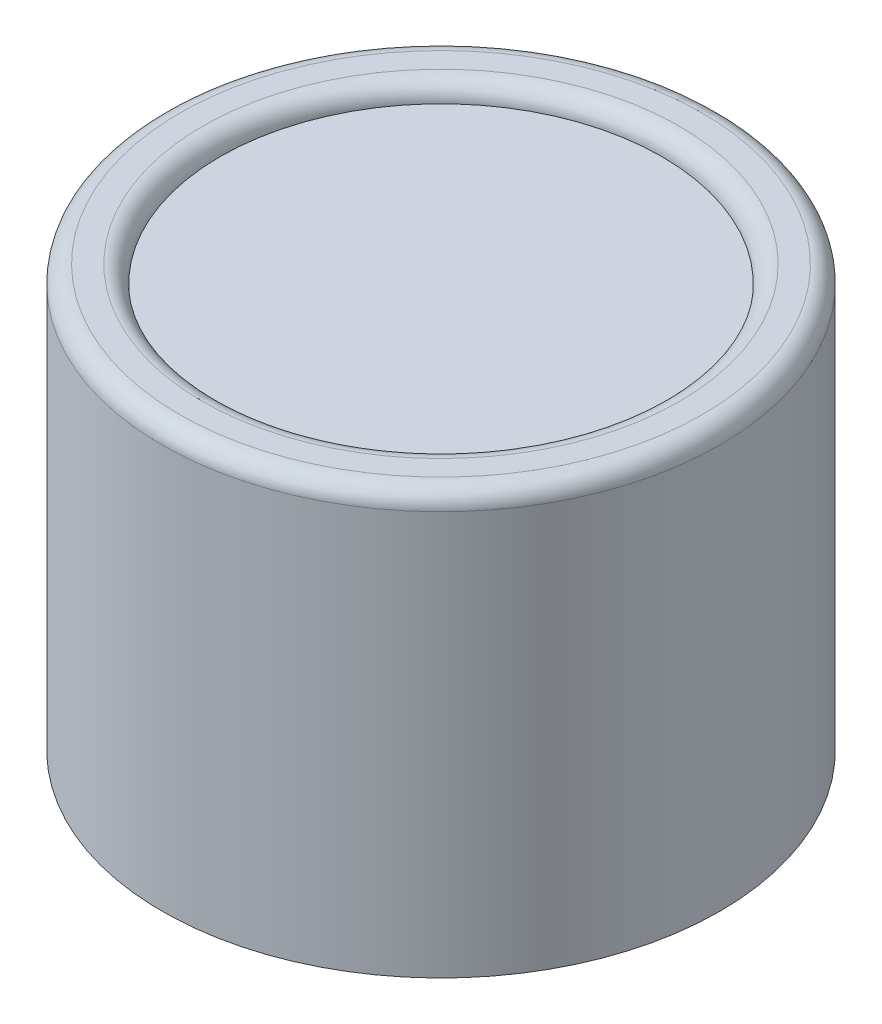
ISO-10303-21;
HEADER;
FILE_DESCRIPTION(('STEP AP214'),'2;1');
FILE_NAME('part.step','',(''),(''),'','','');
FILE_SCHEMA(('AUTOMOTIVE_DESIGN { 1 0 10303 214 1 1 1 1 }'));
ENDSEC;
DATA;
#1=APPLICATION_CONTEXT('core data for automotive mechanical design processes');
#2=APPLICATION_PROTOCOL_DEFINITION('international standard','automotive_design',2000,#1);
#3=PRODUCT_CONTEXT('',#1,'mechanical');
#4=PRODUCT('Part','Part','',(#3));
#5=PRODUCT_RELATED_PRODUCT_CATEGORY('part','',(#4));
#6=PRODUCT_DEFINITION_FORMATION('','',#4);
#7=PRODUCT_DEFINITION_CONTEXT('part definition',#1,'design');
#8=PRODUCT_DEFINITION('design','',#6,#7);
#9=PRODUCT_DEFINITION_SHAPE('','',#8);
#10=(LENGTH_UNIT() NAMED_UNIT(*) SI_UNIT(.MILLI.,.METRE.));
#11=(NAMED_UNIT(*) PLANE_ANGLE_UNIT() SI_UNIT($,.RADIAN.));
#12=(NAMED_UNIT(*) SI_UNIT($,.STERADIAN.) SOLID_ANGLE_UNIT());
#13=UNCERTAINTY_MEASURE_WITH_UNIT(LENGTH_MEASURE(1.E-05),#10,'distance_accuracy_value','');
#14=(GEOMETRIC_REPRESENTATION_CONTEXT(3) GLOBAL_UNCERTAINTY_ASSIGNED_CONTEXT((#13)) GLOBAL_UNIT_ASSIGNED_CONTEXT((#10,
#11,#12)) REPRESENTATION_CONTEXT('',''));
#15=CARTESIAN_POINT('',(0.,0.,0.));
#16=DIRECTION('',(0.,0.,1.));
#17=DIRECTION('',(1.,0.,0.));
#18=AXIS2_PLACEMENT_3D('',#15,#16,#17);
#19=CARTESIAN_POINT('',(6.29,0.,0.));
#20=DIRECTION('',(0.,-1.,0.));
#21=DIRECTION('',(1.,0.,0.));
#22=AXIS2_PLACEMENT_3D('',#19,#20,#21);
#23=PLANE('',#22);
#24=CARTESIAN_POINT('',(0.,0.,0.));
#25=DIRECTION('',(0.,1.,0.));
#26=DIRECTION('',(-1.,0.,0.));
#27=AXIS2_PLACEMENT_3D('',#24,#25,#26);
#28=CIRCLE('',#27,6.29);
#29=CARTESIAN_POINT('',(-6.29,0.,0.));
#30=VERTEX_POINT('',#29);
#31=EDGE_CURVE('E52',#30,#30,#28,.T.);
#32=ORIENTED_EDGE('',*,*,#31,.T.);
#33=EDGE_LOOP('',(#32));
#34=FACE_BOUND('',#33,.T.);
#35=ADVANCED_FACE('F32',(#34),#23,.F.);
#36=CARTESIAN_POINT('',(0.,-11.5,0.));
#37=DIRECTION('',(0.,1.,0.));
#38=DIRECTION('',(-1.,0.,0.));
#39=AXIS2_PLACEMENT_3D('',#36,#37,#38);
#40=PLANE('',#39);
#41=CARTESIAN_POINT('',(0.,-11.5,0.));
#42=DIRECTION('',(0.,1.,0.));
#43=DIRECTION('',(-1.,0.,0.));
#44=AXIS2_PLACEMENT_3D('',#41,#42,#43);
#45=CIRCLE('',#44,7.94);
#46=CARTESIAN_POINT('',(-7.94,-11.5,0.));
#47=VERTEX_POINT('',#46);
#48=EDGE_CURVE('E47',#47,#47,#45,.T.);
#49=ORIENTED_EDGE('',*,*,#48,.F.);
#50=EDGE_LOOP('',(#49));
#51=FACE_BOUND('',#50,.T.);
#52=ADVANCED_FACE('F70',(#51),#40,.F.);
#53=CARTESIAN_POINT('',(0.,0.,0.));
#54=DIRECTION('',(0.,1.,0.));
#55=DIRECTION('',(-1.,0.,0.));
#56=AXIS2_PLACEMENT_3D('',#53,#54,#55);
#57=CYLINDRICAL_SURFACE('',#56,7.94);
#58=CARTESIAN_POINT('',(0.,0.,0.));
#59=DIRECTION('',(0.,-1.,0.));
#60=DIRECTION('',(1.,0.,0.));
#61=AXIS2_PLACEMENT_3D('',#58,#59,#60);
#62=CIRCLE('',#61,7.94);
#63=CARTESIAN_POINT('',(7.94,0.,0.));
#64=VERTEX_POINT('',#63);
#65=EDGE_CURVE('E10',#64,#64,#62,.T.);
#66=ORIENTED_EDGE('',*,*,#65,.T.);
#67=EDGE_LOOP('',(#66));
#68=FACE_BOUND('',#67,.T.);
#69=ORIENTED_EDGE('',*,*,#48,.T.);
#70=EDGE_LOOP('',(#69));
#71=FACE_BOUND('',#70,.T.);
#72=ADVANCED_FACE('F66',(#68,#71),#57,.T.);
#73=CARTESIAN_POINT('',(7.94,0.500000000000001,0.));
#74=DIRECTION('',(0.,-1.,0.));
#75=DIRECTION('',(1.,0.,0.));
#76=AXIS2_PLACEMENT_3D('',#73,#74,#75);
#77=PLANE('',#76);
#78=CARTESIAN_POINT('',(0.,0.5,0.));
#79=DIRECTION('',(0.,-1.,0.));
#80=DIRECTION('',(1.,0.,0.));
#81=AXIS2_PLACEMENT_3D('',#78,#79,#80);
#82=CIRCLE('',#81,6.79);
#83=CARTESIAN_POINT('',(6.79,0.500000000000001,0.));
#84=VERTEX_POINT('',#83);
#85=EDGE_CURVE('E39',#84,#84,#82,.T.);
#86=ORIENTED_EDGE('',*,*,#85,.T.);
#87=EDGE_LOOP('',(#86));
#88=FACE_BOUND('',#87,.T.);
#89=CARTESIAN_POINT('',(0.,0.5,0.));
#90=DIRECTION('',(0.,-1.,0.));
#91=DIRECTION('',(1.,0.,0.));
#92=AXIS2_PLACEMENT_3D('',#89,#90,#91);
#93=CIRCLE('',#92,7.44);
#94=CARTESIAN_POINT('',(7.44,0.500000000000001,0.));
#95=VERTEX_POINT('',#94);
#96=EDGE_CURVE('E43',#95,#95,#93,.F.);
#97=ORIENTED_EDGE('',*,*,#96,.T.);
#98=EDGE_LOOP('',(#97));
#99=FACE_BOUND('',#98,.T.);
#100=ADVANCED_FACE('F59',(#88,#99),#77,.F.);
#101=CARTESIAN_POINT('',(0.,0.,0.));
#102=DIRECTION('',(0.,-1.,0.));
#103=DIRECTION('',(1.,0.,0.));
#104=AXIS2_PLACEMENT_3D('',#101,#102,#103);
#105=TOROIDAL_SURFACE('',#104,6.79,0.5);
#106=ORIENTED_EDGE('',*,*,#85,.F.);
#107=EDGE_LOOP('',(#106));
#108=FACE_BOUND('',#107,.T.);
#109=ORIENTED_EDGE('',*,*,#31,.F.);
#110=EDGE_LOOP('',(#109));
#111=FACE_BOUND('',#110,.T.);
#112=ADVANCED_FACE('F57',(#108,#111),#105,.T.);
#113=CARTESIAN_POINT('',(0.,0.,0.));
#114=DIRECTION('',(0.,-1.,0.));
#115=DIRECTION('',(1.,0.,0.));
#116=AXIS2_PLACEMENT_3D('',#113,#114,#115);
#117=TOROIDAL_SURFACE('',#116,7.44,0.5);
#118=ORIENTED_EDGE('',*,*,#65,.F.);
#119=EDGE_LOOP('',(#118));
#120=FACE_BOUND('',#119,.T.);
#121=ORIENTED_EDGE('',*,*,#96,.F.);
#122=EDGE_LOOP('',(#121));
#123=FACE_BOUND('',#122,.T.);
#124=ADVANCED_FACE('F34',(#120,#123),#117,.T.);
#125=CLOSED_SHELL('',(#35,#52,#72,#100,#112,#124));
#126=MANIFOLD_SOLID_BREP('B2',#125);
#127=ADVANCED_BREP_SHAPE_REPRESENTATION('',(#18,#126),#14);
#128=SHAPE_DEFINITION_REPRESENTATION(#9,#127);
ENDSEC;
END-ISO-10303-21;
